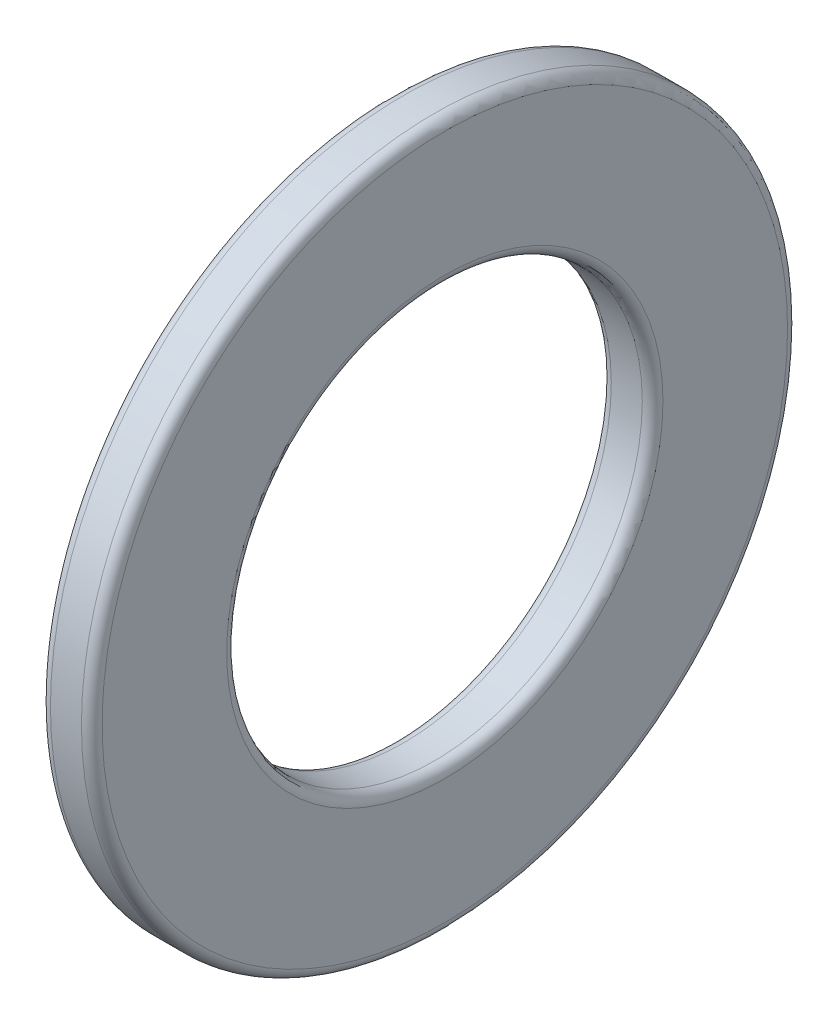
from build123d import *

# Parameters (mm, degrees)
SKETCH1_R           = 11.1125
SKETCH1_R_2         = 6.5405
BOSS_EXTRUDE1_DEPTH = 0.8128
FILLET1_R           = 0.32512


with BuildPart() as part:
    # Sketch1 → Boss-Extrude1 (new, symmetric)
    with BuildSketch(Plane(origin=(0, 0, 0), x_dir=(0, 0, -1), z_dir=(1, 0, 0))):
        Circle(SKETCH1_R)
        Circle(SKETCH1_R_2, mode=Mode.SUBTRACT)
    extrude(amount=BOSS_EXTRUDE1_DEPTH, both=True)

    # Fillet1
    fillet1_edges = [part.edges().sort_by_distance(p)[0] for p in [
        (-0.8128, 0, 11.1125),
        (0.8128, 0, 11.1125),
        (-0.8128, 0, 6.5405),
        (0.8128, 0, 6.5405),
    ]]
    fillet(fillet1_edges, radius=FILLET1_R)


solid = part.part
